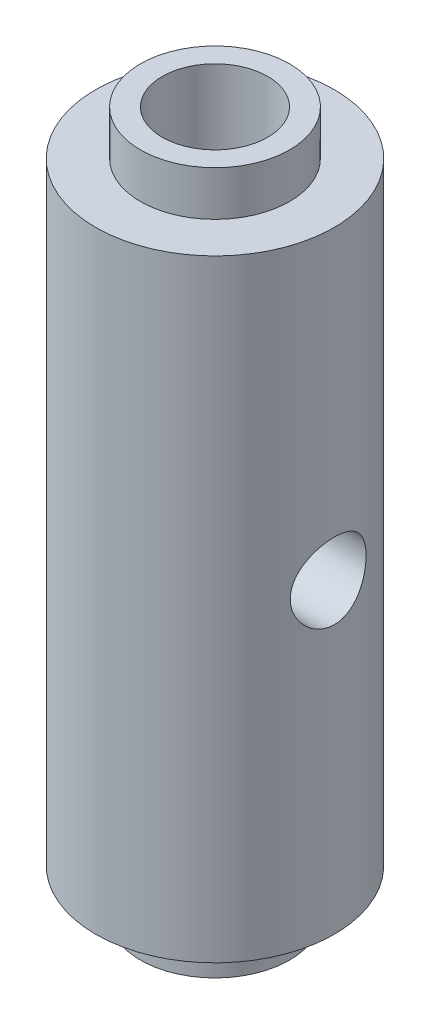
ISO-10303-21;
HEADER;
FILE_DESCRIPTION(('STEP AP214'),'2;1');
FILE_NAME('part.step','',(''),(''),'','','');
FILE_SCHEMA(('AUTOMOTIVE_DESIGN { 1 0 10303 214 1 1 1 1 }'));
ENDSEC;
DATA;
#1=APPLICATION_CONTEXT('core data for automotive mechanical design processes');
#2=APPLICATION_PROTOCOL_DEFINITION('international standard','automotive_design',2000,#1);
#3=PRODUCT_CONTEXT('',#1,'mechanical');
#4=PRODUCT('Part','Part','',(#3));
#5=PRODUCT_RELATED_PRODUCT_CATEGORY('part','',(#4));
#6=PRODUCT_DEFINITION_FORMATION('','',#4);
#7=PRODUCT_DEFINITION_CONTEXT('part definition',#1,'design');
#8=PRODUCT_DEFINITION('design','',#6,#7);
#9=PRODUCT_DEFINITION_SHAPE('','',#8);
#10=(LENGTH_UNIT() NAMED_UNIT(*) SI_UNIT(.MILLI.,.METRE.));
#11=(NAMED_UNIT(*) PLANE_ANGLE_UNIT() SI_UNIT($,.RADIAN.));
#12=(NAMED_UNIT(*) SI_UNIT($,.STERADIAN.) SOLID_ANGLE_UNIT());
#13=UNCERTAINTY_MEASURE_WITH_UNIT(LENGTH_MEASURE(1.E-05),#10,'distance_accuracy_value','');
#14=(GEOMETRIC_REPRESENTATION_CONTEXT(3) GLOBAL_UNCERTAINTY_ASSIGNED_CONTEXT((#13)) GLOBAL_UNIT_ASSIGNED_CONTEXT((#10,
#11,#12)) REPRESENTATION_CONTEXT('',''));
#15=CARTESIAN_POINT('',(0.,0.,0.));
#16=DIRECTION('',(0.,0.,1.));
#17=DIRECTION('',(1.,0.,0.));
#18=AXIS2_PLACEMENT_3D('',#15,#16,#17);
#19=CARTESIAN_POINT('',(-6.35,18.669,0.));
#20=DIRECTION('',(1.,0.,0.));
#21=DIRECTION('',(0.,0.,-1.));
#22=AXIS2_PLACEMENT_3D('',#19,#20,#21);
#23=CYLINDRICAL_SURFACE('',#22,2.0193);
#24=CARTESIAN_POINT('',(-1.94935691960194,18.669,-2.0193));
#25=CARTESIAN_POINT('',(-1.94935781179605,18.6210665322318,-2.01929953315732));
#26=CARTESIAN_POINT('',(-1.95113592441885,18.5731256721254,-2.0175877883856));
#27=CARTESIAN_POINT('',(-1.9581381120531,18.4777264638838,-2.0107910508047));
#28=CARTESIAN_POINT('',(-1.96336435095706,18.4302684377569,-2.00570393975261));
#29=CARTESIAN_POINT('',(-1.98385823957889,18.289079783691,-1.98551183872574));
#30=CARTESIAN_POINT('',(-2.0039396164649,18.1966990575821,-1.96547666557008));
#31=CARTESIAN_POINT('',(-2.05303813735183,18.0192055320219,-1.91410990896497));
#32=CARTESIAN_POINT('',(-2.08194207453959,17.9340171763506,-1.88292062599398));
#33=CARTESIAN_POINT('',(-2.14521847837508,17.7703008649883,-1.81050234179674));
#34=CARTESIAN_POINT('',(-2.17959037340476,17.6917722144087,-1.76927438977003));
#35=CARTESIAN_POINT('',(-2.25761940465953,17.5274970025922,-1.66897301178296));
#36=CARTESIAN_POINT('',(-2.30180840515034,17.4431623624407,-1.60800249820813));
#37=CARTESIAN_POINT('',(-2.39000038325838,17.2846460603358,-1.47374861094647));
#38=CARTESIAN_POINT('',(-2.43400303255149,17.2104781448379,-1.40044885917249));
#39=CARTESIAN_POINT('',(-2.52614704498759,17.0610556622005,-1.22775048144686));
#40=CARTESIAN_POINT('',(-2.57360248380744,16.9880199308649,-1.12602911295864));
#41=CARTESIAN_POINT('',(-2.65843444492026,16.86081958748,-0.907698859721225));
#42=CARTESIAN_POINT('',(-2.69583236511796,16.8066148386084,-0.791122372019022));
#43=CARTESIAN_POINT('',(-2.74741515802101,16.7328252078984,-0.580938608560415));
#44=CARTESIAN_POINT('',(-2.765171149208,16.7077898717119,-0.490106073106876));
#45=CARTESIAN_POINT('',(-2.7916919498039,16.6705689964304,-0.304583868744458));
#46=CARTESIAN_POINT('',(-2.80046421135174,16.6583728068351,-0.209897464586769));
#47=CARTESIAN_POINT('',(-2.80826143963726,16.6475267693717,-0.0191356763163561));
#48=CARTESIAN_POINT('',(-2.80726508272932,16.6489065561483,0.0769422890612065));
#49=CARTESIAN_POINT('',(-2.7955666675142,16.6651955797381,0.26734820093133));
#50=CARTESIAN_POINT('',(-2.78486203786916,16.6801084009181,0.361675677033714));
#51=CARTESIAN_POINT('',(-2.75509160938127,16.7220159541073,0.543409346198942));
#52=CARTESIAN_POINT('',(-2.73626068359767,16.7486717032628,0.630933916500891));
#53=CARTESIAN_POINT('',(-2.69168383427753,16.8127409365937,0.800037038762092));
#54=CARTESIAN_POINT('',(-2.66593653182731,16.8501565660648,0.881614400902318));
#55=CARTESIAN_POINT('',(-2.60599153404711,16.9391438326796,1.04636879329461));
#56=CARTESIAN_POINT('',(-2.57117264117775,16.991826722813,1.12871563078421));
#57=CARTESIAN_POINT('',(-2.49733321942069,17.107379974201,1.28385725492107));
#58=CARTESIAN_POINT('',(-2.45830848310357,17.1702605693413,1.35664231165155));
#59=CARTESIAN_POINT('',(-2.37105217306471,17.317675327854,1.50478147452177));
#60=CARTESIAN_POINT('',(-2.32246048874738,17.4040608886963,1.57808493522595));
#61=CARTESIAN_POINT('',(-2.22730907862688,17.5886388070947,1.70974967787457));
#62=CARTESIAN_POINT('',(-2.1807494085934,17.6868314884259,1.76811054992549));
#63=CARTESIAN_POINT('',(-2.10495043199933,17.8713634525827,1.85725069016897));
#64=CARTESIAN_POINT('',(-2.0741613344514,17.955488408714,1.89127715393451));
#65=CARTESIAN_POINT('',(-2.02084543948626,18.1298699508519,1.9481471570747));
#66=CARTESIAN_POINT('',(-1.99830028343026,18.2201123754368,1.97101558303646));
#67=CARTESIAN_POINT('',(-1.96758304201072,18.3909363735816,2.00164584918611));
#68=CARTESIAN_POINT('',(-1.95774261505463,18.4708907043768,2.01118043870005));
#69=CARTESIAN_POINT('',(-1.94805671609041,18.631952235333,2.02056746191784));
#70=CARTESIAN_POINT('',(-1.94820411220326,18.7130585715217,2.02042680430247));
#71=CARTESIAN_POINT('',(-1.95844796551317,18.8738607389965,2.01049481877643));
#72=CARTESIAN_POINT('',(-1.96852697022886,18.9535587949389,2.00072041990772));
#73=CARTESIAN_POINT('',(-1.99709127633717,19.1098090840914,1.97220437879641));
#74=CARTESIAN_POINT('',(-2.01558917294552,19.1863564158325,1.95344929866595));
#75=CARTESIAN_POINT('',(-2.06768288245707,19.3657325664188,1.89847301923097));
#76=CARTESIAN_POINT('',(-2.10435923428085,19.4664255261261,1.85824097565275));
#77=CARTESIAN_POINT('',(-2.18421644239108,19.6581667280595,1.76368920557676));
#78=CARTESIAN_POINT('',(-2.22741009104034,19.7491953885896,1.70934161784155));
#79=CARTESIAN_POINT('',(-2.3169025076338,19.9235017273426,1.5860319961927));
#80=CARTESIAN_POINT('',(-2.36325414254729,20.0064949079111,1.51670688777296));
#81=CARTESIAN_POINT('',(-2.45393307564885,20.16087306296,1.36512705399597));
#82=CARTESIAN_POINT('',(-2.49826218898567,20.2322685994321,1.28288422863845));
#83=CARTESIAN_POINT('',(-2.57868333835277,20.357718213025,1.11188601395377));
#84=CARTESIAN_POINT('',(-2.61512443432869,20.4126009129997,1.0239080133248));
#85=CARTESIAN_POINT('',(-2.68039566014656,20.5090513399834,0.838275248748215));
#86=CARTESIAN_POINT('',(-2.70922845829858,20.5506237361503,0.740623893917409));
#87=CARTESIAN_POINT('',(-2.75687349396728,20.6186033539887,0.536869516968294));
#88=CARTESIAN_POINT('',(-2.77560517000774,20.6448887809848,0.430706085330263));
#89=CARTESIAN_POINT('',(-2.80063601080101,20.6799014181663,0.214114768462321));
#90=CARTESIAN_POINT('',(-2.80694721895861,20.6886456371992,0.10369112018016));
#91=CARTESIAN_POINT('',(-2.80647155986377,20.6879807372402,-0.102053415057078));
#92=CARTESIAN_POINT('',(-2.80134130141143,20.6808676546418,-0.197396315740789));
#93=CARTESIAN_POINT('',(-2.78174658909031,20.6534932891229,-0.385174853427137));
#94=CARTESIAN_POINT('',(-2.7672814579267,20.6332310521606,-0.477610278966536));
#95=CARTESIAN_POINT('',(-2.73043000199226,20.5809606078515,-0.656157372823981));
#96=CARTESIAN_POINT('',(-2.70813791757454,20.5490919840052,-0.742330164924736));
#97=CARTESIAN_POINT('',(-2.65718575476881,20.4749259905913,-0.907991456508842));
#98=CARTESIAN_POINT('',(-2.62852462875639,20.4326269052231,-0.987478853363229));
#99=CARTESIAN_POINT('',(-2.56233298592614,20.3324794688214,-1.14919633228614));
#100=CARTESIAN_POINT('',(-2.52412579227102,20.2732966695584,-1.23031928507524));
#101=CARTESIAN_POINT('',(-2.44432386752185,20.1445608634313,-1.38210632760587));
#102=CARTESIAN_POINT('',(-2.40272423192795,20.0749927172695,-1.45275484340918));
#103=CARTESIAN_POINT('',(-2.31119295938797,19.912759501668,-1.59510400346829));
#104=CARTESIAN_POINT('',(-2.26114340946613,19.8182023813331,-1.66458219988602));
#105=CARTESIAN_POINT('',(-2.16571304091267,19.6167211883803,-1.78696840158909));
#106=CARTESIAN_POINT('',(-2.12032791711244,19.5098087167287,-1.83989178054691));
#107=CARTESIAN_POINT('',(-2.05331423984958,19.3182698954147,-1.91394185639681));
#108=CARTESIAN_POINT('',(-2.02864193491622,19.2365623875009,-1.9398444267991));
#109=CARTESIAN_POINT('',(-1.98823189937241,19.0685499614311,-1.9812503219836));
#110=CARTESIAN_POINT('',(-1.97246330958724,18.9822620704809,-1.99678959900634));
#111=CARTESIAN_POINT('',(-1.95808960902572,18.8574504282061,-2.01084035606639));
#112=CARTESIAN_POINT('',(-1.95482763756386,18.8199180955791,-2.01400631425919));
#113=CARTESIAN_POINT('',(-1.9504606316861,18.7445920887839,-2.01823662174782));
#114=CARTESIAN_POINT('',(-1.94935621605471,18.7067983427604,-2.01930036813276));
#115=CARTESIAN_POINT('',(-1.94935691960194,18.669,-2.0193));
#116=B_SPLINE_CURVE_WITH_KNOTS('',3,(#24,#25,#26,#27,#28,#29,#30,#31,#32,#33,#34,#35,#36,#37,
#38,#39,#40,#41,#42,#43,#44,#45,#46,#47,#48,#49,#50,#51,#52,#53,#54,#55,#56,#57,#58,#59,#60,#61,
#62,#63,#64,#65,#66,#67,#68,#69,#70,#71,#72,#73,#74,#75,#76,#77,#78,#79,#80,#81,#82,#83,#84,#85,
#86,#87,#88,#89,#90,#91,#92,#93,#94,#95,#96,#97,#98,#99,#100,#101,#102,#103,#104,#105,#106,#107,
#108,#109,#110,#111,#112,#113,#114,#115),.UNSPECIFIED.,.T.,.F.,(4,2,2,2,2,2,2,2,2,2,2,2,2,2,2,2,
2,2,2,2,2,2,2,2,2,2,2,2,2,2,2,2,2,2,2,2,2,2,2,2,2,2,2,2,2,4),(0.,0.143746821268,
0.287583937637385,0.575742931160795,0.86034966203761,1.14492665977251,1.48291949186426,
1.82136490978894,2.2208808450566,2.61953994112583,2.90595043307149,3.19212315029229,
3.47892068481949,3.76579420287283,4.04487985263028,4.32402118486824,4.63419182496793,
4.94467568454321,5.31304134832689,5.68141711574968,5.96793862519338,6.25381812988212,
6.49607186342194,6.7381526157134,6.97980872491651,7.22182756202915,7.56336300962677,
7.90557777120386,8.25727054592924,8.60864121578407,8.9370383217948,9.26532010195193,
9.59618275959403,9.92672444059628,10.2125446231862,10.4983855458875,10.7808965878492,
11.0634541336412,11.3845878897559,11.7061944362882,12.0872872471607,12.468025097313,
12.7347004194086,13.0004457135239,13.1137659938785,13.2271187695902),.UNSPECIFIED.);
#117=CARTESIAN_POINT('',(-1.94935691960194,18.669,-2.0193));
#118=VERTEX_POINT('',#117);
#119=EDGE_CURVE('E40',#118,#118,#116,.T.);
#120=ORIENTED_EDGE('',*,*,#119,.F.);
#121=EDGE_LOOP('',(#120));
#122=FACE_BOUND('',#121,.T.);
#123=CARTESIAN_POINT('',(-6.35,16.6497,0.));
#124=CARTESIAN_POINT('',(-6.34999965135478,16.6497004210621,0.110461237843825));
#125=CARTESIAN_POINT('',(-6.34709066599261,16.6587935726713,0.220927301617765));
#126=CARTESIAN_POINT('',(-6.3357715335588,16.6948264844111,0.4386228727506));
#127=CARTESIAN_POINT('',(-6.32736031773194,16.7217697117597,0.545851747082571));
#128=CARTESIAN_POINT('',(-6.30595432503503,16.7924979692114,0.753902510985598));
#129=CARTESIAN_POINT('',(-6.29296679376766,16.8362563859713,0.854734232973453));
#130=CARTESIAN_POINT('',(-6.26374515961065,16.9392578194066,1.04762875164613));
#131=CARTESIAN_POINT('',(-6.24751051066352,16.9985034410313,1.1396900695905));
#132=CARTESIAN_POINT('',(-6.21293556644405,17.1327833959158,1.31536398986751));
#133=CARTESIAN_POINT('',(-6.19454819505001,17.2082222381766,1.39865809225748));
#134=CARTESIAN_POINT('',(-6.15800925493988,17.371886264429,1.55165112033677));
#135=CARTESIAN_POINT('',(-6.13985773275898,17.4601139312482,1.62134739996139));
#136=CARTESIAN_POINT('',(-6.10533725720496,17.6496367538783,1.74691669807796));
#137=CARTESIAN_POINT('',(-6.0890262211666,17.7512098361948,1.80238767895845));
#138=CARTESIAN_POINT('',(-6.06074356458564,17.9628456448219,1.89532704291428));
#139=CARTESIAN_POINT('',(-6.04877075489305,18.0729060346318,1.9328003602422));
#140=CARTESIAN_POINT('',(-6.03101341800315,18.2947907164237,1.98750761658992));
#141=CARTESIAN_POINT('',(-6.02504825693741,18.4064540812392,2.0053339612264));
#142=CARTESIAN_POINT('',(-6.01944581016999,18.6313338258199,2.02209234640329));
#143=CARTESIAN_POINT('',(-6.01980677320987,18.7445497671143,2.02102961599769));
#144=CARTESIAN_POINT('',(-6.02665664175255,18.9643820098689,2.00050248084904));
#145=CARTESIAN_POINT('',(-6.03289306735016,19.0710783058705,1.98179621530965));
#146=CARTESIAN_POINT('',(-6.05038024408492,19.2797315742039,1.92774418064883));
#147=CARTESIAN_POINT('',(-6.06163154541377,19.3816880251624,1.89239658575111));
#148=CARTESIAN_POINT('',(-6.08807068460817,19.5797517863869,1.8055401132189));
#149=CARTESIAN_POINT('',(-6.10331506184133,19.6757483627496,1.75379667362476));
#150=CARTESIAN_POINT('',(-6.13599736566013,19.8579425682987,1.6357801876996));
#151=CARTESIAN_POINT('',(-6.15343587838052,19.9441375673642,1.56950325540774));
#152=CARTESIAN_POINT('',(-6.18954941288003,20.1085613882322,1.4206013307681));
#153=CARTESIAN_POINT('',(-6.20824393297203,20.1862216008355,1.33735200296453));
#154=CARTESIAN_POINT('',(-6.24403812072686,20.3266198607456,1.15877933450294));
#155=CARTESIAN_POINT('',(-6.26113766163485,20.3893567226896,1.06345503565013));
#156=CARTESIAN_POINT('',(-6.29200590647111,20.4985311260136,0.862314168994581));
#157=CARTESIAN_POINT('',(-6.30574571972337,20.5448287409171,0.75641691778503));
#158=CARTESIAN_POINT('',(-6.32813760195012,20.6187820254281,0.537797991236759));
#159=CARTESIAN_POINT('',(-6.33679127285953,20.6464435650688,0.425078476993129));
#160=CARTESIAN_POINT('',(-6.34777609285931,20.6813609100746,0.2008378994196));
#161=CARTESIAN_POINT('',(-6.3503454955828,20.6893860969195,0.089448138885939));
#162=CARTESIAN_POINT('',(-6.34957948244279,20.6869779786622,-0.133100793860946));
#163=CARTESIAN_POINT('',(-6.34624496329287,20.6765474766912,-0.244259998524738));
#164=CARTESIAN_POINT('',(-6.33420254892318,20.6381395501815,-0.460195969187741));
#165=CARTESIAN_POINT('',(-6.32563608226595,20.6106236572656,-0.56506347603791));
#166=CARTESIAN_POINT('',(-6.30413743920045,20.5393927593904,-0.768660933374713));
#167=CARTESIAN_POINT('',(-6.29120471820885,20.4956757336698,-0.86739011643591));
#168=CARTESIAN_POINT('',(-6.26189827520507,20.3920687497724,-1.05864500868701));
#169=CARTESIAN_POINT('',(-6.24544686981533,20.3318030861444,-1.15095495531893));
#170=CARTESIAN_POINT('',(-6.21098037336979,20.197257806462,-1.32440771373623));
#171=CARTESIAN_POINT('',(-6.19296484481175,20.1229742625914,-1.40554738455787));
#172=CARTESIAN_POINT('',(-6.15646633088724,19.958882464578,-1.55782236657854));
#173=CARTESIAN_POINT('',(-6.13799458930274,19.8685614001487,-1.62840903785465));
#174=CARTESIAN_POINT('',(-6.10344492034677,19.6769555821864,-1.75347782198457));
#175=CARTESIAN_POINT('',(-6.08736696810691,19.5756709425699,-1.80796010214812));
#176=CARTESIAN_POINT('',(-6.05959924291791,19.3651635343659,-1.89895395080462));
#177=CARTESIAN_POINT('',(-6.04789435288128,19.2559696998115,-1.93552756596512));
#178=CARTESIAN_POINT('',(-6.0303151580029,19.0325222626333,-1.98962911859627));
#179=CARTESIAN_POINT('',(-6.0244385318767,18.9182706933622,-2.00716463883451));
#180=CARTESIAN_POINT('',(-6.0194289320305,18.6937029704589,-2.02213518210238));
#181=CARTESIAN_POINT('',(-6.01999309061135,18.5834530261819,-2.02047290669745));
#182=CARTESIAN_POINT('',(-6.02706235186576,18.3648871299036,-1.99928519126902));
#183=CARTESIAN_POINT('',(-6.03356715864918,18.2565710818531,-1.97976064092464));
#184=CARTESIAN_POINT('',(-6.05156946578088,18.0466249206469,-1.92401617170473));
#185=CARTESIAN_POINT('',(-6.06298693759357,17.9449165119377,-1.88806331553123));
#186=CARTESIAN_POINT('',(-6.08950522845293,17.7488949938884,-1.80069449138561));
#187=CARTESIAN_POINT('',(-6.10460681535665,17.6545834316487,-1.7492752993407));
#188=CARTESIAN_POINT('',(-6.13755118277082,17.4719157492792,-1.63001052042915));
#189=CARTESIAN_POINT('',(-6.15547992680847,17.383952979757,-1.56158629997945));
#190=CARTESIAN_POINT('',(-6.19167260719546,17.2204659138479,-1.41126154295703));
#191=CARTESIAN_POINT('',(-6.2099366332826,17.1449450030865,-1.32935735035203));
#192=CARTESIAN_POINT('',(-6.24549246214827,17.0058917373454,-1.15102457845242));
#193=CARTESIAN_POINT('',(-6.26272955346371,16.9428584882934,-1.0541946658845));
#194=CARTESIAN_POINT('',(-6.2935885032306,16.8340443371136,-0.850766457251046));
#195=CARTESIAN_POINT('',(-6.30721165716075,16.7882572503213,-0.744171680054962));
#196=CARTESIAN_POINT('',(-6.32846797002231,16.7182030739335,-0.532412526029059));
#197=CARTESIAN_POINT('',(-6.33647079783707,16.6925904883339,-0.427729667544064));
#198=CARTESIAN_POINT('',(-6.34723640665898,16.6583406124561,-0.215365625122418));
#199=CARTESIAN_POINT('',(-6.350000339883,16.6496995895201,-0.107685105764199));
#200=CARTESIAN_POINT('',(-6.35,16.6497,0.));
#201=B_SPLINE_CURVE_WITH_KNOTS('',3,(#123,#124,#125,#126,#127,#128,#129,#130,#131,#132,#133,
#134,#135,#136,#137,#138,#139,#140,#141,#142,#143,#144,#145,#146,#147,#148,#149,#150,#151,#152,
#153,#154,#155,#156,#157,#158,#159,#160,#161,#162,#163,#164,#165,#166,#167,#168,#169,#170,#171,
#172,#173,#174,#175,#176,#177,#178,#179,#180,#181,#182,#183,#184,#185,#186,#187,#188,#189,#190,
#191,#192,#193,#194,#195,#196,#197,#198,#199,#200),.UNSPECIFIED.,.T.,.F.,(4,2,2,2,2,2,2,2,2,2,2,
2,2,2,2,2,2,2,2,2,2,2,2,2,2,2,2,2,2,2,2,2,2,2,2,2,2,2,4),(0.,0.330987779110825,0.66203986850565,
0.992570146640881,1.32315605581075,1.66323439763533,2.00337885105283,2.35227959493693,
2.70108462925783,3.03905729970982,3.37693641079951,3.70092804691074,4.02495523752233,
4.35384489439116,4.68282259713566,5.02733983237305,5.3718844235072,5.71929509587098,
6.06659628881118,6.40005485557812,6.73346277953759,7.05823415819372,7.38304605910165,
7.71594819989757,8.0489437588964,8.39563339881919,8.74231943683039,9.08779568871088,
9.4331342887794,9.76230345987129,10.0914562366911,10.4154387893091,10.7394889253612,
11.076602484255,11.413807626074,11.7625602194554,12.1111876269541,12.4339279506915,
12.7565972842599),.UNSPECIFIED.);
#202=CARTESIAN_POINT('',(-6.35,16.6497,0.));
#203=VERTEX_POINT('',#202);
#204=EDGE_CURVE('E10',#203,#203,#201,.T.);
#205=ORIENTED_EDGE('',*,*,#204,.T.);
#206=EDGE_LOOP('',(#205));
#207=FACE_BOUND('',#206,.T.);
#208=ADVANCED_FACE('F36',(#122,#207),#23,.F.);
#209=CARTESIAN_POINT('',(0.,0.,0.));
#210=DIRECTION('',(0.,-1.,0.));
#211=DIRECTION('',(0.,0.,-1.));
#212=AXIS2_PLACEMENT_3D('',#209,#210,#211);
#213=CYLINDRICAL_SURFACE('',#212,6.35);
#214=CARTESIAN_POINT('',(6.02037602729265,18.669,-2.0193));
#215=CARTESIAN_POINT('',(6.02037646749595,18.7793017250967,-2.01929956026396));
#216=CARTESIAN_POINT('',(6.0234405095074,18.8896082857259,-2.01023170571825));
#217=CARTESIAN_POINT('',(6.03530902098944,19.1069736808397,-1.97430838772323));
#218=CARTESIAN_POINT('',(6.04411488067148,19.21403172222,-1.94744861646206));
#219=CARTESIAN_POINT('',(6.06637097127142,19.421719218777,-1.87696408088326));
#220=CARTESIAN_POINT('',(6.07981275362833,19.5223599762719,-1.83336979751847));
#221=CARTESIAN_POINT('',(6.10981426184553,19.7149285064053,-1.73075607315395));
#222=CARTESIAN_POINT('',(6.12637457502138,19.8068546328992,-1.67173372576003));
#223=CARTESIAN_POINT('',(6.16140806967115,19.9826551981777,-1.53769017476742));
#224=CARTESIAN_POINT('',(6.17992573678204,20.0661740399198,-1.46221411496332));
#225=CARTESIAN_POINT('',(6.21640959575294,20.2196081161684,-1.29837827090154));
#226=CARTESIAN_POINT('',(6.23437570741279,20.2895213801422,-1.21001662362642));
#227=CARTESIAN_POINT('',(6.26824262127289,20.4153402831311,-1.0203508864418));
#228=CARTESIAN_POINT('',(6.28408495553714,20.4708780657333,-0.918791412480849));
#229=CARTESIAN_POINT('',(6.31139862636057,20.5639444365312,-0.707183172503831));
#230=CARTESIAN_POINT('',(6.32287102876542,20.6014774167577,-0.597136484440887));
#231=CARTESIAN_POINT('',(6.33983727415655,20.6562766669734,-0.375402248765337));
#232=CARTESIAN_POINT('',(6.34551010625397,20.6741510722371,-0.263878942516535));
#233=CARTESIAN_POINT('',(6.35087102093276,20.6910543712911,-0.0392815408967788));
#234=CARTESIAN_POINT('',(6.35056051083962,20.6900876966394,0.0737921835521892));
#235=CARTESIAN_POINT('',(6.34411349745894,20.6697326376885,0.293994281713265));
#236=CARTESIAN_POINT('',(6.3381855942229,20.6510038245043,0.401190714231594));
#237=CARTESIAN_POINT('',(6.32142779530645,20.5967405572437,0.610831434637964));
#238=CARTESIAN_POINT('',(6.31059757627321,20.5612049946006,0.713275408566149));
#239=CARTESIAN_POINT('',(6.28497575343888,20.4739232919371,0.91200434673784));
#240=CARTESIAN_POINT('',(6.27013636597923,20.4219802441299,1.00819641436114));
#241=CARTESIAN_POINT('',(6.23805487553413,20.3035170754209,1.19070146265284));
#242=CARTESIAN_POINT('',(6.22081214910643,20.2369931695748,1.27701186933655));
#243=CARTESIAN_POINT('',(6.18487809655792,20.0878862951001,1.44123438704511));
#244=CARTESIAN_POINT('',(6.1661563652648,20.0047349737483,1.5186245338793));
#245=CARTESIAN_POINT('',(6.13001158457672,19.8264630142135,1.65852100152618));
#246=CARTESIAN_POINT('',(6.11258869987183,19.7313408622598,1.72102543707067));
#247=CARTESIAN_POINT('',(6.08085745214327,19.5303066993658,1.83001268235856));
#248=CARTESIAN_POINT('',(6.06658875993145,19.4242794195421,1.87629528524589));
#249=CARTESIAN_POINT('',(6.04324496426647,19.2053717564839,1.95018184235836));
#250=CARTESIAN_POINT('',(6.03416791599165,19.0924939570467,1.97779279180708));
#251=CARTESIAN_POINT('',(6.02266901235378,18.8681048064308,2.01253096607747));
#252=CARTESIAN_POINT('',(6.01998680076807,18.7567308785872,2.02046009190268));
#253=CARTESIAN_POINT('',(6.02085712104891,18.5342339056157,2.01786600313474));
#254=CARTESIAN_POINT('',(6.02440864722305,18.4231108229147,2.00734576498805));
#255=CARTESIAN_POINT('',(6.03708856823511,18.2077720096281,1.96886928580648));
#256=CARTESIAN_POINT('',(6.04604481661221,18.103449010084,1.94145072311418));
#257=CARTESIAN_POINT('',(6.06834083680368,17.9008982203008,1.87059075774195));
#258=CARTESIAN_POINT('',(6.08168134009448,17.8026714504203,1.82714668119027));
#259=CARTESIAN_POINT('',(6.11173074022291,17.6118950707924,1.72400857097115));
#260=CARTESIAN_POINT('',(6.12852735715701,17.5195982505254,1.66387317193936));
#261=CARTESIAN_POINT('',(6.16341780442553,17.3461141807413,1.5295707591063));
#262=CARTESIAN_POINT('',(6.18151198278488,17.2649299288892,1.45539997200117));
#263=CARTESIAN_POINT('',(6.21790333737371,17.1123605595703,1.29132738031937));
#264=CARTESIAN_POINT('',(6.23617559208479,17.0415493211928,1.20088494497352));
#265=CARTESIAN_POINT('',(6.27008679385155,16.9160825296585,1.00895693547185));
#266=CARTESIAN_POINT('',(6.28572585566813,16.86142627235,0.907471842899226));
#267=CARTESIAN_POINT('',(6.31252283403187,16.7703411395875,0.696937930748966));
#268=CARTESIAN_POINT('',(6.3237124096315,16.7337830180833,0.587949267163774));
#269=CARTESIAN_POINT('',(6.34048842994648,16.6796440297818,0.364950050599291));
#270=CARTESIAN_POINT('',(6.34607669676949,16.6620569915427,0.250941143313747));
#271=CARTESIAN_POINT('',(6.35089535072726,16.6468749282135,0.0264114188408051));
#272=CARTESIAN_POINT('',(6.35038892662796,16.6484523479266,-0.0840484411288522));
#273=CARTESIAN_POINT('',(6.34371005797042,16.6695428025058,-0.303057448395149));
#274=CARTESIAN_POINT('',(6.33753800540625,16.6890545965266,-0.411606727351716));
#275=CARTESIAN_POINT('',(6.32030819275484,16.7449268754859,-0.622284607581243));
#276=CARTESIAN_POINT('',(6.30931673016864,16.7810590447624,-0.724479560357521));
#277=CARTESIAN_POINT('',(6.28358080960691,16.8689390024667,-0.921403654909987));
#278=CARTESIAN_POINT('',(6.26883569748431,16.9206895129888,-1.01613149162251));
#279=CARTESIAN_POINT('',(6.23648860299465,17.0404140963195,-1.19901515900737));
#280=CARTESIAN_POINT('',(6.21880516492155,17.1088893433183,-1.28682832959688));
#281=CARTESIAN_POINT('',(6.18280030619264,17.2592439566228,-1.44999131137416));
#282=CARTESIAN_POINT('',(6.16447869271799,17.3411274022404,-1.5253373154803));
#283=CARTESIAN_POINT('',(6.12851531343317,17.5193739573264,-1.66406780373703));
#284=CARTESIAN_POINT('',(6.11091912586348,17.6161405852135,-1.72694714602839));
#285=CARTESIAN_POINT('',(6.07920201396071,17.8194022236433,-1.83548834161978));
#286=CARTESIAN_POINT('',(6.06507980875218,17.9258936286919,-1.88115654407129));
#287=CARTESIAN_POINT('',(6.04295675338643,18.137388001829,-1.95100445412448));
#288=CARTESIAN_POINT('',(6.03457652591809,18.241904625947,-1.97653786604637));
#289=CARTESIAN_POINT('',(6.02328668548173,18.4539465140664,-2.01068357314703));
#290=CARTESIAN_POINT('',(6.02037559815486,18.5614709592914,-2.01930042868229));
#291=CARTESIAN_POINT('',(6.02037602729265,18.669,-2.0193));
#292=B_SPLINE_CURVE_WITH_KNOTS('',3,(#214,#215,#216,#217,#218,#219,#220,#221,#222,#223,#224,
#225,#226,#227,#228,#229,#230,#231,#232,#233,#234,#235,#236,#237,#238,#239,#240,#241,#242,#243,
#244,#245,#246,#247,#248,#249,#250,#251,#252,#253,#254,#255,#256,#257,#258,#259,#260,#261,#262,
#263,#264,#265,#266,#267,#268,#269,#270,#271,#272,#273,#274,#275,#276,#277,#278,#279,#280,#281,
#282,#283,#284,#285,#286,#287,#288,#289,#290,#291),.UNSPECIFIED.,.T.,.F.,(4,2,2,2,2,2,2,2,2,2,2,
2,2,2,2,2,2,2,2,2,2,2,2,2,2,2,2,2,2,2,2,2,2,2,2,2,2,2,4),(0.,0.330507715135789,
0.661095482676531,0.99108393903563,1.32113460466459,1.66183698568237,2.00258867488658,
2.35134936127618,2.70002492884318,3.03758123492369,3.37505814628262,3.70047464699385,
4.02591261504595,4.35541490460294,4.68500282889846,5.02878905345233,5.37261879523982,
5.72055382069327,6.06835842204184,6.40174099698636,6.73506979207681,7.05830409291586,
7.3815923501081,7.71441285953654,8.04732297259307,8.39459593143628,8.74185375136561,
9.08659454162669,9.43122315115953,9.7610249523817,10.0908039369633,10.416182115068,
10.7416170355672,11.0783581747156,11.4152019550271,11.7637215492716,12.1121124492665,
12.4343989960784,12.7565986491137),.UNSPECIFIED.);
#293=CARTESIAN_POINT('',(6.02037602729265,18.669,-2.0193));
#294=VERTEX_POINT('',#293);
#295=EDGE_CURVE('E61',#294,#294,#292,.T.);
#296=ORIENTED_EDGE('',*,*,#295,.F.);
#297=EDGE_LOOP('',(#296));
#298=FACE_BOUND('',#297,.T.);
#299=CARTESIAN_POINT('',(0.,2.38125,0.));
#300=DIRECTION('',(0.,-1.,0.));
#301=DIRECTION('',(0.,0.,-1.));
#302=AXIS2_PLACEMENT_3D('',#299,#300,#301);
#303=CIRCLE('',#302,6.35000000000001);
#304=CARTESIAN_POINT('',(0.,2.38125,-6.35000000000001));
#305=VERTEX_POINT('',#304);
#306=EDGE_CURVE('E129',#305,#305,#303,.T.);
#307=ORIENTED_EDGE('',*,*,#306,.F.);
#308=EDGE_LOOP('',(#307));
#309=FACE_BOUND('',#308,.T.);
#310=CARTESIAN_POINT('',(0.,34.95675,0.));
#311=DIRECTION('',(0.,-1.,0.));
#312=DIRECTION('',(0.,0.,-1.));
#313=AXIS2_PLACEMENT_3D('',#310,#311,#312);
#314=CIRCLE('',#313,6.35);
#315=CARTESIAN_POINT('',(0.,34.95675,-6.35));
#316=VERTEX_POINT('',#315);
#317=EDGE_CURVE('E133',#316,#316,#314,.T.);
#318=ORIENTED_EDGE('',*,*,#317,.T.);
#319=EDGE_LOOP('',(#318));
#320=FACE_BOUND('',#319,.T.);
#321=ORIENTED_EDGE('',*,*,#204,.F.);
#322=EDGE_LOOP('',(#321));
#323=FACE_BOUND('',#322,.T.);
#324=ADVANCED_FACE('F69',(#298,#309,#320,#323),#213,.T.);
#325=CARTESIAN_POINT('',(0.,37.338,0.));
#326=DIRECTION('',(0.,-1.,0.));
#327=DIRECTION('',(0.,0.,-1.));
#328=AXIS2_PLACEMENT_3D('',#325,#326,#327);
#329=PLANE('',#328);
#330=CARTESIAN_POINT('',(0.,37.338,0.));
#331=DIRECTION('',(0.,1.,0.));
#332=DIRECTION('',(0.,0.,1.));
#333=AXIS2_PLACEMENT_3D('',#330,#331,#332);
#334=CIRCLE('',#333,2.8067);
#335=CARTESIAN_POINT('',(0.,37.338,2.8067));
#336=VERTEX_POINT('',#335);
#337=EDGE_CURVE('E117',#336,#336,#334,.T.);
#338=ORIENTED_EDGE('',*,*,#337,.F.);
#339=EDGE_LOOP('',(#338));
#340=FACE_BOUND('',#339,.T.);
#341=CARTESIAN_POINT('',(0.,37.338,0.));
#342=DIRECTION('',(0.,-1.,0.));
#343=DIRECTION('',(0.,0.,-1.));
#344=AXIS2_PLACEMENT_3D('',#341,#342,#343);
#345=CIRCLE('',#344,3.96875);
#346=CARTESIAN_POINT('',(0.,37.338,-3.96875));
#347=VERTEX_POINT('',#346);
#348=EDGE_CURVE('E49',#347,#347,#345,.T.);
#349=ORIENTED_EDGE('',*,*,#348,.F.);
#350=EDGE_LOOP('',(#349));
#351=FACE_BOUND('',#350,.T.);
#352=ADVANCED_FACE('F38',(#340,#351),#329,.F.);
#353=CARTESIAN_POINT('',(0.,0.,0.));
#354=DIRECTION('',(0.,-1.,0.));
#355=DIRECTION('',(0.,0.,-1.));
#356=AXIS2_PLACEMENT_3D('',#353,#354,#355);
#357=CYLINDRICAL_SURFACE('',#356,3.96875);
#358=CARTESIAN_POINT('',(0.,34.95675,0.));
#359=DIRECTION('',(0.,-1.,0.));
#360=DIRECTION('',(0.,0.,-1.));
#361=AXIS2_PLACEMENT_3D('',#358,#359,#360);
#362=CIRCLE('',#361,3.96875);
#363=CARTESIAN_POINT('',(0.,34.95675,-3.96875));
#364=VERTEX_POINT('',#363);
#365=EDGE_CURVE('E54',#364,#364,#362,.T.);
#366=ORIENTED_EDGE('',*,*,#365,.F.);
#367=EDGE_LOOP('',(#366));
#368=FACE_BOUND('',#367,.T.);
#369=ORIENTED_EDGE('',*,*,#348,.T.);
#370=EDGE_LOOP('',(#369));
#371=FACE_BOUND('',#370,.T.);
#372=ADVANCED_FACE('F97',(#368,#371),#357,.T.);
#373=CARTESIAN_POINT('',(-3.96875,34.95675,0.));
#374=DIRECTION('',(0.,-1.,0.));
#375=DIRECTION('',(0.,0.,-1.));
#376=AXIS2_PLACEMENT_3D('',#373,#374,#375);
#377=PLANE('',#376);
#378=ORIENTED_EDGE('',*,*,#317,.F.);
#379=EDGE_LOOP('',(#378));
#380=FACE_BOUND('',#379,.T.);
#381=ORIENTED_EDGE('',*,*,#365,.T.);
#382=EDGE_LOOP('',(#381));
#383=FACE_BOUND('',#382,.T.);
#384=ADVANCED_FACE('F92',(#380,#383),#377,.F.);
#385=CARTESIAN_POINT('',(-6.35000000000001,2.38125,0.));
#386=DIRECTION('',(0.,1.,0.));
#387=DIRECTION('',(0.,0.,1.));
#388=AXIS2_PLACEMENT_3D('',#385,#386,#387);
#389=PLANE('',#388);
#390=CARTESIAN_POINT('',(0.,2.38125,0.));
#391=DIRECTION('',(0.,-1.,0.));
#392=DIRECTION('',(0.,0.,-1.));
#393=AXIS2_PLACEMENT_3D('',#390,#391,#392);
#394=CIRCLE('',#393,3.96875);
#395=CARTESIAN_POINT('',(0.,2.38125,-3.96875));
#396=VERTEX_POINT('',#395);
#397=EDGE_CURVE('E125',#396,#396,#394,.T.);
#398=ORIENTED_EDGE('',*,*,#397,.F.);
#399=EDGE_LOOP('',(#398));
#400=FACE_BOUND('',#399,.T.);
#401=ORIENTED_EDGE('',*,*,#306,.T.);
#402=EDGE_LOOP('',(#401));
#403=FACE_BOUND('',#402,.T.);
#404=ADVANCED_FACE('F89',(#400,#403),#389,.F.);
#405=CARTESIAN_POINT('',(0.,0.,0.));
#406=DIRECTION('',(0.,-1.,0.));
#407=DIRECTION('',(0.,0.,-1.));
#408=AXIS2_PLACEMENT_3D('',#405,#406,#407);
#409=CYLINDRICAL_SURFACE('',#408,3.96875);
#410=CARTESIAN_POINT('',(0.,0.,0.));
#411=DIRECTION('',(0.,-1.,0.));
#412=DIRECTION('',(0.,0.,-1.));
#413=AXIS2_PLACEMENT_3D('',#410,#411,#412);
#414=CIRCLE('',#413,3.96875);
#415=CARTESIAN_POINT('',(0.,0.,-3.96875));
#416=VERTEX_POINT('',#415);
#417=EDGE_CURVE('E111',#416,#416,#414,.T.);
#418=ORIENTED_EDGE('',*,*,#417,.F.);
#419=EDGE_LOOP('',(#418));
#420=FACE_BOUND('',#419,.T.);
#421=ORIENTED_EDGE('',*,*,#397,.T.);
#422=EDGE_LOOP('',(#421));
#423=FACE_BOUND('',#422,.T.);
#424=ADVANCED_FACE('F86',(#420,#423),#409,.T.);
#425=CARTESIAN_POINT('',(-3.96875,0.,0.));
#426=DIRECTION('',(0.,1.,0.));
#427=DIRECTION('',(0.,0.,1.));
#428=AXIS2_PLACEMENT_3D('',#425,#426,#427);
#429=PLANE('',#428);
#430=CARTESIAN_POINT('',(0.,0.,0.));
#431=DIRECTION('',(0.,1.,0.));
#432=DIRECTION('',(0.,0.,1.));
#433=AXIS2_PLACEMENT_3D('',#430,#431,#432);
#434=CIRCLE('',#433,2.8067);
#435=CARTESIAN_POINT('',(0.,0.,2.8067));
#436=VERTEX_POINT('',#435);
#437=EDGE_CURVE('E113',#436,#436,#434,.T.);
#438=ORIENTED_EDGE('',*,*,#437,.T.);
#439=EDGE_LOOP('',(#438));
#440=FACE_BOUND('',#439,.T.);
#441=ORIENTED_EDGE('',*,*,#417,.T.);
#442=EDGE_LOOP('',(#441));
#443=FACE_BOUND('',#442,.T.);
#444=ADVANCED_FACE('F78',(#440,#443),#429,.F.);
#445=CARTESIAN_POINT('',(1.94935691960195,18.669,-2.0193));
#446=CARTESIAN_POINT('',(1.94935781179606,18.7169334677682,-2.01929953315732));
#447=CARTESIAN_POINT('',(1.95113592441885,18.7648743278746,-2.0175877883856));
#448=CARTESIAN_POINT('',(1.9581381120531,18.8602735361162,-2.0107910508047));
#449=CARTESIAN_POINT('',(1.96336435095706,18.9077315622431,-2.00570393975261));
#450=CARTESIAN_POINT('',(1.98385823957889,19.048920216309,-1.98551183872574));
#451=CARTESIAN_POINT('',(2.0039396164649,19.1413009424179,-1.96547666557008));
#452=CARTESIAN_POINT('',(2.05303813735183,19.3187944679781,-1.91410990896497));
#453=CARTESIAN_POINT('',(2.08194207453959,19.4039828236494,-1.88292062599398));
#454=CARTESIAN_POINT('',(2.14521847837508,19.5676991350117,-1.81050234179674));
#455=CARTESIAN_POINT('',(2.17959037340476,19.6462277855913,-1.76927438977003));
#456=CARTESIAN_POINT('',(2.25761940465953,19.8105029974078,-1.66897301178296));
#457=CARTESIAN_POINT('',(2.30180840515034,19.8948376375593,-1.60800249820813));
#458=CARTESIAN_POINT('',(2.39000038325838,20.0533539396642,-1.47374861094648));
#459=CARTESIAN_POINT('',(2.43400303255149,20.1275218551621,-1.40044885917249));
#460=CARTESIAN_POINT('',(2.52614704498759,20.2769443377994,-1.22775048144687));
#461=CARTESIAN_POINT('',(2.57360248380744,20.3499800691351,-1.12602911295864));
#462=CARTESIAN_POINT('',(2.65843444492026,20.47718041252,-0.907698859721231));
#463=CARTESIAN_POINT('',(2.69583236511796,20.5313851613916,-0.791122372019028));
#464=CARTESIAN_POINT('',(2.74741515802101,20.6051747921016,-0.580938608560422));
#465=CARTESIAN_POINT('',(2.765171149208,20.6302101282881,-0.490106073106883));
#466=CARTESIAN_POINT('',(2.7916919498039,20.6674310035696,-0.304583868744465));
#467=CARTESIAN_POINT('',(2.80046421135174,20.6796271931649,-0.209897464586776));
#468=CARTESIAN_POINT('',(2.80826143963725,20.6904732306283,-0.0191356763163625));
#469=CARTESIAN_POINT('',(2.80726508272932,20.6890934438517,0.0769422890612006));
#470=CARTESIAN_POINT('',(2.7955666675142,20.6728044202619,0.267348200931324));
#471=CARTESIAN_POINT('',(2.78486203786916,20.6578915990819,0.361675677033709));
#472=CARTESIAN_POINT('',(2.75509160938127,20.6159840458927,0.543409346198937));
#473=CARTESIAN_POINT('',(2.73626068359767,20.5893282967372,0.630933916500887));
#474=CARTESIAN_POINT('',(2.69168383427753,20.5252590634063,0.800037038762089));
#475=CARTESIAN_POINT('',(2.66593653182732,20.4878434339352,0.881614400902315));
#476=CARTESIAN_POINT('',(2.60599153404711,20.3988561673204,1.04636879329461));
#477=CARTESIAN_POINT('',(2.57117264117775,20.346173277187,1.1287156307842));
#478=CARTESIAN_POINT('',(2.49733321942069,20.230620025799,1.28385725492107));
#479=CARTESIAN_POINT('',(2.45830848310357,20.1677394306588,1.35664231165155));
#480=CARTESIAN_POINT('',(2.37105217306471,20.020324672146,1.50478147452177));
#481=CARTESIAN_POINT('',(2.32246048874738,19.9339391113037,1.57808493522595));
#482=CARTESIAN_POINT('',(2.22730907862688,19.7493611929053,1.70974967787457));
#483=CARTESIAN_POINT('',(2.1807494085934,19.6511685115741,1.76811054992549));
#484=CARTESIAN_POINT('',(2.10495043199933,19.4666365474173,1.85725069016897));
#485=CARTESIAN_POINT('',(2.0741613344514,19.382511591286,1.89127715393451));
#486=CARTESIAN_POINT('',(2.02084543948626,19.2081300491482,1.9481471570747));
#487=CARTESIAN_POINT('',(1.99830028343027,19.1178876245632,1.97101558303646));
#488=CARTESIAN_POINT('',(1.96758304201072,18.9470636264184,2.00164584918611));
#489=CARTESIAN_POINT('',(1.95774261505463,18.8671092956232,2.01118043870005));
#490=CARTESIAN_POINT('',(1.94805671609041,18.706047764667,2.02056746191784));
#491=CARTESIAN_POINT('',(1.94820411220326,18.6249414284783,2.02042680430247));
#492=CARTESIAN_POINT('',(1.95844796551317,18.4641392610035,2.01049481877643));
#493=CARTESIAN_POINT('',(1.96852697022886,18.3844412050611,2.00072041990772));
#494=CARTESIAN_POINT('',(1.99709127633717,18.2281909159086,1.97220437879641));
#495=CARTESIAN_POINT('',(2.01558917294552,18.1516435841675,1.95344929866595));
#496=CARTESIAN_POINT('',(2.06768288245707,17.9722674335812,1.89847301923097));
#497=CARTESIAN_POINT('',(2.10435923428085,17.8715744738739,1.85824097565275));
#498=CARTESIAN_POINT('',(2.18421644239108,17.6798332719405,1.76368920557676));
#499=CARTESIAN_POINT('',(2.22741009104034,17.5888046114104,1.70934161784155));
#500=CARTESIAN_POINT('',(2.3169025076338,17.4144982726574,1.58603199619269));
#501=CARTESIAN_POINT('',(2.3632541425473,17.3315050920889,1.51670688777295));
#502=CARTESIAN_POINT('',(2.45393307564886,17.17712693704,1.36512705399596));
#503=CARTESIAN_POINT('',(2.49826218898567,17.1057314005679,1.28288422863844));
#504=CARTESIAN_POINT('',(2.57868333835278,16.9802817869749,1.11188601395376));
#505=CARTESIAN_POINT('',(2.6151244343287,16.9253990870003,1.02390801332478));
#506=CARTESIAN_POINT('',(2.68039566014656,16.8289486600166,0.838275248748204));
#507=CARTESIAN_POINT('',(2.70922845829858,16.7873762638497,0.740623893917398));
#508=CARTESIAN_POINT('',(2.75687349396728,16.7193966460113,0.536869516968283));
#509=CARTESIAN_POINT('',(2.77560517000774,16.6931112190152,0.430706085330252));
#510=CARTESIAN_POINT('',(2.80063601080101,16.6580985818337,0.214114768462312));
#511=CARTESIAN_POINT('',(2.80694721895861,16.6493543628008,0.103691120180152));
#512=CARTESIAN_POINT('',(2.80647155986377,16.6500192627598,-0.102053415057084));
#513=CARTESIAN_POINT('',(2.80134130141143,16.6571323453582,-0.197396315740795));
#514=CARTESIAN_POINT('',(2.78174658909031,16.6845067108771,-0.385174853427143));
#515=CARTESIAN_POINT('',(2.7672814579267,16.7047689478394,-0.477610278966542));
#516=CARTESIAN_POINT('',(2.73043000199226,16.7570393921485,-0.656157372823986));
#517=CARTESIAN_POINT('',(2.70813791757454,16.7889080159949,-0.742330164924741));
#518=CARTESIAN_POINT('',(2.65718575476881,16.8630740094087,-0.907991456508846));
#519=CARTESIAN_POINT('',(2.62852462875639,16.9053730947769,-0.987478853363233));
#520=CARTESIAN_POINT('',(2.56233298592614,17.0055205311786,-1.14919633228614));
#521=CARTESIAN_POINT('',(2.52412579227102,17.0647033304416,-1.23031928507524));
#522=CARTESIAN_POINT('',(2.44432386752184,17.1934391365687,-1.38210632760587));
#523=CARTESIAN_POINT('',(2.40272423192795,17.2630072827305,-1.45275484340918));
#524=CARTESIAN_POINT('',(2.31119295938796,17.425240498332,-1.59510400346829));
#525=CARTESIAN_POINT('',(2.26114340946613,17.5197976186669,-1.66458219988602));
#526=CARTESIAN_POINT('',(2.16571304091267,17.7212788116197,-1.78696840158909));
#527=CARTESIAN_POINT('',(2.12032791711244,17.8281912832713,-1.83989178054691));
#528=CARTESIAN_POINT('',(2.05331423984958,18.0197301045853,-1.91394185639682));
#529=CARTESIAN_POINT('',(2.02864193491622,18.1014376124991,-1.9398444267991));
#530=CARTESIAN_POINT('',(1.98823189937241,18.2694500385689,-1.9812503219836));
#531=CARTESIAN_POINT('',(1.97246330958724,18.3557379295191,-1.99678959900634));
#532=CARTESIAN_POINT('',(1.95808960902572,18.480549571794,-2.0108403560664));
#533=CARTESIAN_POINT('',(1.95482763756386,18.5180819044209,-2.01400631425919));
#534=CARTESIAN_POINT('',(1.9504606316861,18.5934079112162,-2.01823662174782));
#535=CARTESIAN_POINT('',(1.94935621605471,18.6312016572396,-2.01930036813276));
#536=CARTESIAN_POINT('',(1.94935691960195,18.669,-2.0193));
#537=B_SPLINE_CURVE_WITH_KNOTS('',3,(#445,#446,#447,#448,#449,#450,#451,#452,#453,#454,#455,
#456,#457,#458,#459,#460,#461,#462,#463,#464,#465,#466,#467,#468,#469,#470,#471,#472,#473,#474,
#475,#476,#477,#478,#479,#480,#481,#482,#483,#484,#485,#486,#487,#488,#489,#490,#491,#492,#493,
#494,#495,#496,#497,#498,#499,#500,#501,#502,#503,#504,#505,#506,#507,#508,#509,#510,#511,#512,
#513,#514,#515,#516,#517,#518,#519,#520,#521,#522,#523,#524,#525,#526,#527,#528,#529,#530,#531,
#532,#533,#534,#535,#536),.UNSPECIFIED.,.T.,.F.,(4,2,2,2,2,2,2,2,2,2,2,2,2,2,2,2,2,2,2,2,2,2,2,
2,2,2,2,2,2,2,2,2,2,2,2,2,2,2,2,2,2,2,2,2,2,4),(0.,0.143746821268,0.287583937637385,
0.575742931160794,0.860349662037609,1.14492665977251,1.48291949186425,1.82136490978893,
2.22088084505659,2.61953994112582,2.90595043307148,3.19212315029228,3.47892068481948,
3.76579420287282,4.04487985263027,4.32402118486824,4.63419182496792,4.94467568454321,
5.31304134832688,5.68141711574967,5.96793862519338,6.25381812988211,6.49607186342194,
6.73815261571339,6.97980872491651,7.22182756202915,7.56336300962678,7.90557777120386,
8.25727054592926,8.60864121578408,8.93703832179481,9.26532010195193,9.59618275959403,
9.92672444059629,10.2125446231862,10.4983855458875,10.7808965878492,11.0634541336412,
11.3845878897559,11.7061944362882,12.0872872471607,12.468025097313,12.7347004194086,
13.0004457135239,13.1137659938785,13.2271187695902),.UNSPECIFIED.);
#538=CARTESIAN_POINT('',(1.94935691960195,18.669,-2.0193));
#539=VERTEX_POINT('',#538);
#540=EDGE_CURVE('E65',#539,#539,#537,.T.);
#541=ORIENTED_EDGE('',*,*,#540,.F.);
#542=EDGE_LOOP('',(#541));
#543=FACE_BOUND('',#542,.T.);
#544=ORIENTED_EDGE('',*,*,#295,.T.);
#545=EDGE_LOOP('',(#544));
#546=FACE_BOUND('',#545,.T.);
#547=ADVANCED_FACE('F73',(#543,#546),#23,.F.);
#548=CARTESIAN_POINT('',(0.,0.,0.));
#549=DIRECTION('',(0.,1.,0.));
#550=DIRECTION('',(0.,0.,1.));
#551=AXIS2_PLACEMENT_3D('',#548,#549,#550);
#552=CYLINDRICAL_SURFACE('',#551,2.8067);
#553=ORIENTED_EDGE('',*,*,#119,.T.);
#554=EDGE_LOOP('',(#553));
#555=FACE_BOUND('',#554,.T.);
#556=ORIENTED_EDGE('',*,*,#540,.T.);
#557=EDGE_LOOP('',(#556));
#558=FACE_BOUND('',#557,.T.);
#559=ORIENTED_EDGE('',*,*,#437,.F.);
#560=EDGE_LOOP('',(#559));
#561=FACE_BOUND('',#560,.T.);
#562=ORIENTED_EDGE('',*,*,#337,.T.);
#563=EDGE_LOOP('',(#562));
#564=FACE_BOUND('',#563,.T.);
#565=ADVANCED_FACE('F77',(#555,#558,#561,#564),#552,.F.);
#566=CLOSED_SHELL('',(#208,#324,#352,#372,#384,#404,#424,#444,#547,#565));
#567=MANIFOLD_SOLID_BREP('B2',#566);
#568=ADVANCED_BREP_SHAPE_REPRESENTATION('',(#18,#567),#14);
#569=SHAPE_DEFINITION_REPRESENTATION(#9,#568);
ENDSEC;
END-ISO-10303-21;
